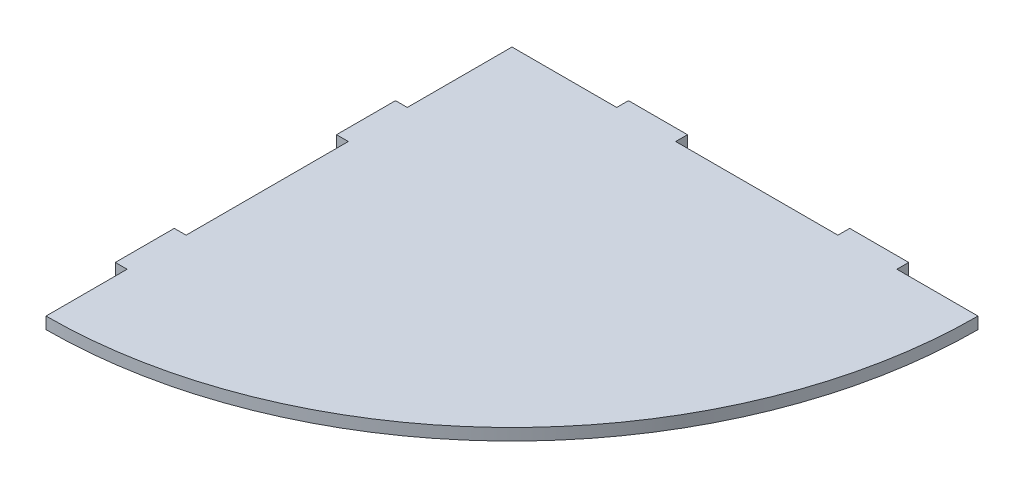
from build123d import *

# Parameters (mm, degrees)
SALIENTE_EXTRUIR1_DEPTH = 4


with BuildPart() as part:
    # Croquis1 → Saliente-Extruir1 (new body)
    with BuildSketch(Plane(origin=(0, 0, 0), x_dir=(1, 0, 0), z_dir=(0, 1, 0))):
        with BuildLine():
            ThreePointArc((158, 0), (111.722871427, -111.722871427), (0, -158))
            Line((0, -158), (0, -130.5))
            Line((0, -130.5), (-4, -130.5))
            Line((-4, -130.5), (-4, -110.5))
            Line((-4, -110.5), (0, -110.5))
            Line((0, -110.5), (0, -55.5))
            Line((0, -55.5), (-4, -55.5))
            Line((-4, -55.5), (-4, -35.5))
            Line((-4, -35.5), (0, -35.5))
            Line((0, -35.5), (0, 0))
            Line((0, 0), (35.5, 0))
            Line((35.5, 0), (35.5, 4))
            Line((35.5, 4), (55.5, 4))
            Line((55.5, 4), (55.5, 0))
            Line((55.5, 0), (110.5, 0))
            Line((110.5, 0), (110.5, 4))
            Line((110.5, 4), (130.5, 4))
            Line((130.5, 4), (130.5, 0))
            Line((130.5, 0), (158, 0))
        make_face()
    extrude(amount=SALIENTE_EXTRUIR1_DEPTH)


solid = part.part
